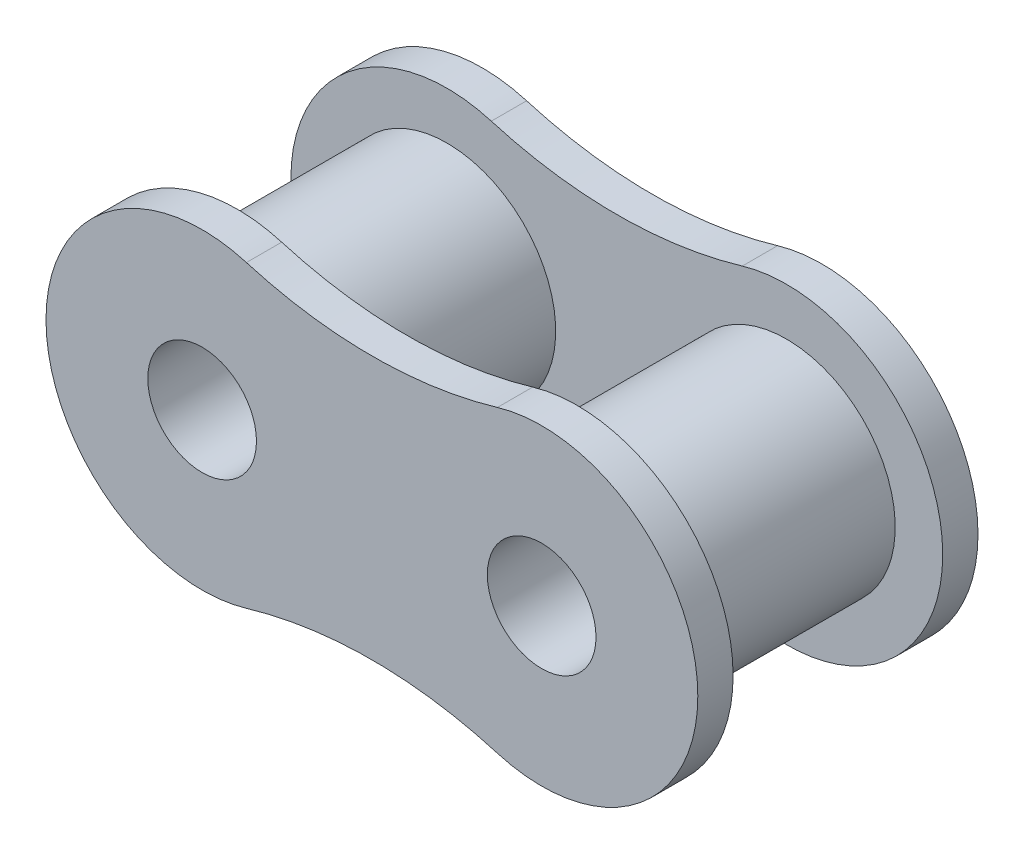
from build123d import *

# Parameters (mm, degrees)
SKETCH1_R             = 5.08
SKETCH1_R_2           = 2.54
BOSS_EXTRUDE1_DEPTH   = 4.9
BOSS_EXTRUDE1_2_DEPTH = 4.9
SKETCH2_R             = 2.54
BOSS_EXTRUDE2_DEPTH   = 1.65
BOSS_EXTRUDE3_START   = 1.65
SKETCH3_R             = 2.54
BOSS_EXTRUDE3_DEPTH   = 1.65


with BuildPart() as part:
    # Sketch1 → Boss-Extrude1 (new, symmetric)
    with BuildSketch(Plane.XY):
        Circle(SKETCH1_R)
        Circle(SKETCH1_R_2, mode=Mode.SUBTRACT)
    extrude(amount=BOSS_EXTRUDE1_DEPTH, both=True)



with BuildPart() as body_2:
    # Sketch1 → Boss-Extrude1 2 (new, symmetric)
    with BuildSketch(Plane.XY):
        with Locations((-15.875, 0)):
            Circle(SKETCH1_R)
        with Locations((-15.875, 0)):
            Circle(SKETCH1_R_2, mode=Mode.SUBTRACT)
    extrude(amount=BOSS_EXTRUDE1_2_DEPTH, both=True)


with BuildPart() as part_1:
    add(part.part)

    add(body_2.part)  # Boss-Extrude2 merges body 2
    # Sketch2 → Boss-Extrude2 (add)
    with BuildSketch(Plane.XY.offset(4.9)):
        with BuildLine():
            ThreePointArc((-2.070158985, -7.000317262), (7.3, 0), (-2.070158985, 7.000317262))
            ThreePointArc((-2.070158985, 7.000317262), (-7.9375, 6.15094249), (-13.804841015, 7.000317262))
            ThreePointArc((-13.804841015, 7.000317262), (-23.175, 0), (-13.804841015, -7.000317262))
            ThreePointArc((-13.804841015, -7.000317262), (-7.9375, -6.15094249), (-2.070158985, -7.000317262))
        make_face()
        Circle(SKETCH2_R, mode=Mode.SUBTRACT)
        with Locations((-15.875, 0)):
            Circle(SKETCH2_R, mode=Mode.SUBTRACT)
    extrude(amount=BOSS_EXTRUDE2_DEPTH)

    # Sketch3 → Boss-Extrude3 (add)
    with BuildSketch(Plane(origin=(0, 0, -4.9), x_dir=(-1, 0, 0), z_dir=(0, 0, -1)).offset(BOSS_EXTRUDE3_START)):
        with BuildLine():
            ThreePointArc((2.070158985, 7.000317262), (-7.3, 0), (2.070158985, -7.000317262))
            ThreePointArc((2.070158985, -7.000317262), (7.9375, -6.15094249), (13.804841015, -7.000317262))
            ThreePointArc((13.804841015, -7.000317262), (23.175, 0), (13.804841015, 7.000317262))
            ThreePointArc((13.804841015, 7.000317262), (7.9375, 6.15094249), (2.070158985, 7.000317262))
        make_face()
        Circle(SKETCH3_R, mode=Mode.SUBTRACT)
        with Locations((15.875, 0)):
            Circle(SKETCH3_R, mode=Mode.SUBTRACT)
    extrude(amount=-BOSS_EXTRUDE3_DEPTH)


solid = part_1.part
